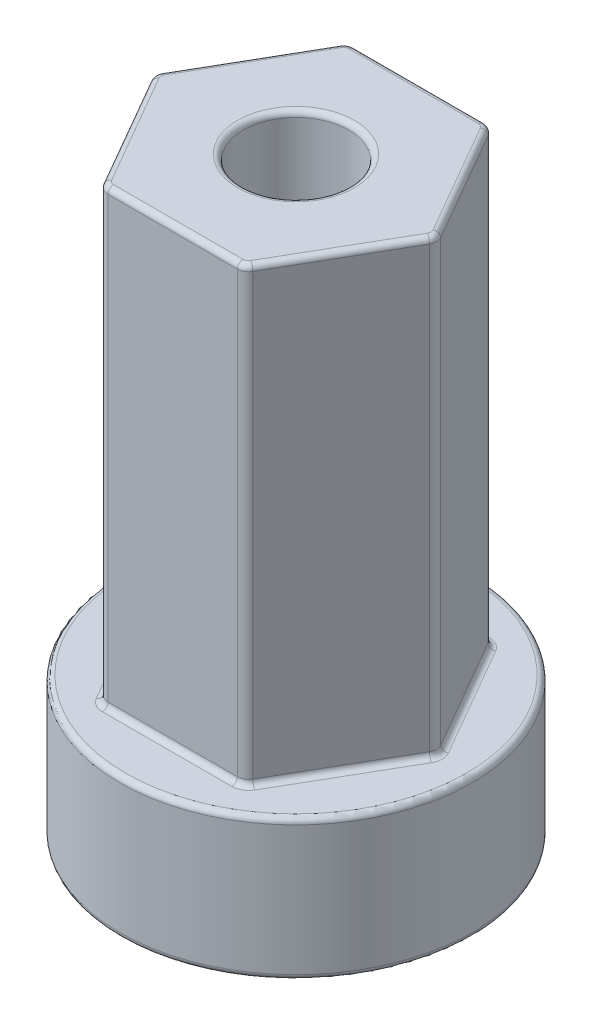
ISO-10303-21;
HEADER;
FILE_DESCRIPTION(('STEP AP214'),'2;1');
FILE_NAME('part.step','',(''),(''),'','','');
FILE_SCHEMA(('AUTOMOTIVE_DESIGN { 1 0 10303 214 1 1 1 1 }'));
ENDSEC;
DATA;
#1=APPLICATION_CONTEXT('core data for automotive mechanical design processes');
#2=APPLICATION_PROTOCOL_DEFINITION('international standard','automotive_design',2000,#1);
#3=PRODUCT_CONTEXT('',#1,'mechanical');
#4=PRODUCT('Part','Part','',(#3));
#5=PRODUCT_RELATED_PRODUCT_CATEGORY('part','',(#4));
#6=PRODUCT_DEFINITION_FORMATION('','',#4);
#7=PRODUCT_DEFINITION_CONTEXT('part definition',#1,'design');
#8=PRODUCT_DEFINITION('design','',#6,#7);
#9=PRODUCT_DEFINITION_SHAPE('','',#8);
#10=(LENGTH_UNIT() NAMED_UNIT(*) SI_UNIT(.MILLI.,.METRE.));
#11=(NAMED_UNIT(*) PLANE_ANGLE_UNIT() SI_UNIT($,.RADIAN.));
#12=(NAMED_UNIT(*) SI_UNIT($,.STERADIAN.) SOLID_ANGLE_UNIT());
#13=UNCERTAINTY_MEASURE_WITH_UNIT(LENGTH_MEASURE(1.E-05),#10,'distance_accuracy_value','');
#14=(GEOMETRIC_REPRESENTATION_CONTEXT(3) GLOBAL_UNCERTAINTY_ASSIGNED_CONTEXT((#13)) GLOBAL_UNIT_ASSIGNED_CONTEXT((#10,
#11,#12)) REPRESENTATION_CONTEXT('',''));
#15=CARTESIAN_POINT('',(0.,0.,0.));
#16=DIRECTION('',(0.,0.,1.));
#17=DIRECTION('',(1.,0.,0.));
#18=AXIS2_PLACEMENT_3D('',#15,#16,#17);
#19=CARTESIAN_POINT('',(0.,6.35,0.));
#20=DIRECTION('',(0.,1.,0.));
#21=DIRECTION('',(0.,0.,1.));
#22=AXIS2_PLACEMENT_3D('',#19,#20,#21);
#23=PLANE('',#22);
#24=DIRECTION('',(1.,0.,0.));
#25=VECTOR('',#24,1.);
#26=CARTESIAN_POINT('',(0.,6.35,5.81025));
#27=LINE('',#26,#25);
#28=CARTESIAN_POINT('',(2.91460849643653,6.35,5.81025));
#29=VERTEX_POINT('',#28);
#30=CARTESIAN_POINT('',(-2.91460849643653,6.35,5.81025));
#31=VERTEX_POINT('',#30);
#32=EDGE_CURVE('E34',#29,#31,#27,.F.);
#33=ORIENTED_EDGE('',*,*,#32,.T.);
#34=CARTESIAN_POINT('',(-2.91460849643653,6.35,5.04825));
#35=DIRECTION('',(0.,1.,0.));
#36=DIRECTION('',(0.,0.,1.));
#37=AXIS2_PLACEMENT_3D('',#34,#35,#36);
#38=CIRCLE('',#37,0.762);
#39=CARTESIAN_POINT('',(-3.57451985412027,6.35,5.42925));
#40=VERTEX_POINT('',#39);
#41=EDGE_CURVE('E11',#31,#40,#38,.F.);
#42=ORIENTED_EDGE('',*,*,#41,.T.);
#43=DIRECTION('',(0.5,0.,0.866025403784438));
#44=VECTOR('',#43,1.);
#45=CARTESIAN_POINT('',(-5.03182410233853,6.35,2.905125));
#46=LINE('',#45,#44);
#47=CARTESIAN_POINT('',(-6.4891283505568,6.35,0.381000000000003));
#48=VERTEX_POINT('',#47);
#49=EDGE_CURVE('E269',#40,#48,#46,.F.);
#50=ORIENTED_EDGE('',*,*,#49,.T.);
#51=CARTESIAN_POINT('',(-5.82921699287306,6.35,0.));
#52=DIRECTION('',(0.,1.,0.));
#53=DIRECTION('',(0.,0.,1.));
#54=AXIS2_PLACEMENT_3D('',#51,#52,#53);
#55=CIRCLE('',#54,0.762);
#56=CARTESIAN_POINT('',(-6.4891283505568,6.35,-0.380999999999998));
#57=VERTEX_POINT('',#56);
#58=EDGE_CURVE('E271',#48,#57,#55,.F.);
#59=ORIENTED_EDGE('',*,*,#58,.T.);
#60=DIRECTION('',(-0.5,0.,0.866025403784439));
#61=VECTOR('',#60,1.);
#62=CARTESIAN_POINT('',(-5.03182410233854,6.35,-2.905125));
#63=LINE('',#62,#61);
#64=CARTESIAN_POINT('',(-3.57451985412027,6.35,-5.42925));
#65=VERTEX_POINT('',#64);
#66=EDGE_CURVE('E273',#57,#65,#63,.F.);
#67=ORIENTED_EDGE('',*,*,#66,.T.);
#68=CARTESIAN_POINT('',(-2.91460849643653,6.35,-5.04825));
#69=DIRECTION('',(0.,1.,0.));
#70=DIRECTION('',(0.,0.,1.));
#71=AXIS2_PLACEMENT_3D('',#68,#69,#70);
#72=CIRCLE('',#71,0.762);
#73=CARTESIAN_POINT('',(-2.91460849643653,6.35,-5.81025));
#74=VERTEX_POINT('',#73);
#75=EDGE_CURVE('E275',#65,#74,#72,.F.);
#76=ORIENTED_EDGE('',*,*,#75,.T.);
#77=DIRECTION('',(-1.,0.,0.));
#78=VECTOR('',#77,1.);
#79=CARTESIAN_POINT('',(0.,6.35,-5.81025));
#80=LINE('',#79,#78);
#81=CARTESIAN_POINT('',(2.91460849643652,6.35,-5.81025));
#82=VERTEX_POINT('',#81);
#83=EDGE_CURVE('E277',#74,#82,#80,.F.);
#84=ORIENTED_EDGE('',*,*,#83,.T.);
#85=CARTESIAN_POINT('',(2.91460849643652,6.35,-5.04825));
#86=DIRECTION('',(0.,1.,0.));
#87=DIRECTION('',(0.,0.,1.));
#88=AXIS2_PLACEMENT_3D('',#85,#86,#87);
#89=CIRCLE('',#88,0.762);
#90=CARTESIAN_POINT('',(3.57451985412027,6.35,-5.42925));
#91=VERTEX_POINT('',#90);
#92=EDGE_CURVE('E279',#82,#91,#89,.F.);
#93=ORIENTED_EDGE('',*,*,#92,.T.);
#94=DIRECTION('',(-0.5,0.,-0.866025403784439));
#95=VECTOR('',#94,1.);
#96=CARTESIAN_POINT('',(5.03182410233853,6.35,-2.905125));
#97=LINE('',#96,#95);
#98=CARTESIAN_POINT('',(6.4891283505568,6.35,-0.381));
#99=VERTEX_POINT('',#98);
#100=EDGE_CURVE('E281',#91,#99,#97,.F.);
#101=ORIENTED_EDGE('',*,*,#100,.T.);
#102=CARTESIAN_POINT('',(5.82921699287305,6.35,0.));
#103=DIRECTION('',(0.,1.,0.));
#104=DIRECTION('',(0.,0.,1.));
#105=AXIS2_PLACEMENT_3D('',#102,#103,#104);
#106=CIRCLE('',#105,0.762);
#107=CARTESIAN_POINT('',(6.4891283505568,6.35,0.381));
#108=VERTEX_POINT('',#107);
#109=EDGE_CURVE('E283',#99,#108,#106,.F.);
#110=ORIENTED_EDGE('',*,*,#109,.T.);
#111=DIRECTION('',(0.5,0.,-0.866025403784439));
#112=VECTOR('',#111,1.);
#113=CARTESIAN_POINT('',(5.03182410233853,6.35,2.905125));
#114=LINE('',#113,#112);
#115=CARTESIAN_POINT('',(3.57451985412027,6.35,5.42925));
#116=VERTEX_POINT('',#115);
#117=EDGE_CURVE('E285',#108,#116,#114,.F.);
#118=ORIENTED_EDGE('',*,*,#117,.T.);
#119=CARTESIAN_POINT('',(2.91460849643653,6.35,5.04825));
#120=DIRECTION('',(0.,1.,0.));
#121=DIRECTION('',(0.,0.,1.));
#122=AXIS2_PLACEMENT_3D('',#119,#120,#121);
#123=CIRCLE('',#122,0.762);
#124=EDGE_CURVE('E44',#116,#29,#123,.F.);
#125=ORIENTED_EDGE('',*,*,#124,.T.);
#126=EDGE_LOOP('',(#33,#42,#50,#59,#67,#76,#84,#93,#101,#110,#118,#125));
#127=FACE_BOUND('',#126,.T.);
#128=CARTESIAN_POINT('',(0.,6.35,0.));
#129=DIRECTION('',(0.,1.,0.));
#130=DIRECTION('',(0.,0.,1.));
#131=AXIS2_PLACEMENT_3D('',#128,#129,#130);
#132=CIRCLE('',#131,7.6835);
#133=CARTESIAN_POINT('',(0.,6.35,7.6835));
#134=VERTEX_POINT('',#133);
#135=EDGE_CURVE('E266',#134,#134,#132,.T.);
#136=ORIENTED_EDGE('',*,*,#135,.T.);
#137=EDGE_LOOP('',(#136));
#138=FACE_BOUND('',#137,.T.);
#139=ADVANCED_FACE('F26',(#127,#138),#23,.T.);
#140=CARTESIAN_POINT('',(0.,6.35,0.));
#141=DIRECTION('',(0.,-1.,0.));
#142=DIRECTION('',(0.,0.,-1.));
#143=AXIS2_PLACEMENT_3D('',#140,#141,#142);
#144=CYLINDRICAL_SURFACE('',#143,7.9375);
#145=CARTESIAN_POINT('',(0.,0.254,0.));
#146=DIRECTION('',(0.,1.,0.));
#147=DIRECTION('',(0.,0.,1.));
#148=AXIS2_PLACEMENT_3D('',#145,#146,#147);
#149=CIRCLE('',#148,7.9375);
#150=CARTESIAN_POINT('',(0.,0.254,7.9375));
#151=VERTEX_POINT('',#150);
#152=EDGE_CURVE('E419',#151,#151,#149,.T.);
#153=ORIENTED_EDGE('',*,*,#152,.T.);
#154=EDGE_LOOP('',(#153));
#155=FACE_BOUND('',#154,.T.);
#156=CARTESIAN_POINT('',(0.,6.096,0.));
#157=DIRECTION('',(0.,1.,0.));
#158=DIRECTION('',(0.,0.,1.));
#159=AXIS2_PLACEMENT_3D('',#156,#157,#158);
#160=CIRCLE('',#159,7.9375);
#161=CARTESIAN_POINT('',(0.,6.096,7.9375));
#162=VERTEX_POINT('',#161);
#163=EDGE_CURVE('E416',#162,#162,#160,.F.);
#164=ORIENTED_EDGE('',*,*,#163,.T.);
#165=EDGE_LOOP('',(#164));
#166=FACE_BOUND('',#165,.T.);
#167=ADVANCED_FACE('F28',(#155,#166),#144,.T.);
#168=CARTESIAN_POINT('',(0.,0.,0.));
#169=DIRECTION('',(0.,1.,0.));
#170=DIRECTION('',(0.,0.,1.));
#171=AXIS2_PLACEMENT_3D('',#168,#169,#170);
#172=PLANE('',#171);
#173=CARTESIAN_POINT('',(0.,0.,0.));
#174=DIRECTION('',(0.,1.,0.));
#175=DIRECTION('',(0.,0.,1.));
#176=AXIS2_PLACEMENT_3D('',#173,#174,#175);
#177=CIRCLE('',#176,7.6835);
#178=CARTESIAN_POINT('',(0.,0.,7.6835));
#179=VERTEX_POINT('',#178);
#180=EDGE_CURVE('E425',#179,#179,#177,.F.);
#181=ORIENTED_EDGE('',*,*,#180,.T.);
#182=EDGE_LOOP('',(#181));
#183=FACE_BOUND('',#182,.T.);
#184=CARTESIAN_POINT('',(0.,0.,0.));
#185=DIRECTION('',(0.,1.,0.));
#186=DIRECTION('',(0.,0.,1.));
#187=AXIS2_PLACEMENT_3D('',#184,#185,#186);
#188=CIRCLE('',#187,2.63525);
#189=CARTESIAN_POINT('',(0.,0.,2.63525));
#190=VERTEX_POINT('',#189);
#191=EDGE_CURVE('E422',#190,#190,#188,.T.);
#192=ORIENTED_EDGE('',*,*,#191,.T.);
#193=EDGE_LOOP('',(#192));
#194=FACE_BOUND('',#193,.T.);
#195=ADVANCED_FACE('F572',(#183,#194),#172,.F.);
#196=CARTESIAN_POINT('',(-3.20790243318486,26.67,-5.55625));
#197=DIRECTION('',(0.866025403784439,0.,0.5));
#198=DIRECTION('',(0.5,0.,-0.866025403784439));
#199=AXIS2_PLACEMENT_3D('',#196,#197,#198);
#200=PLANE('',#199);
#201=DIRECTION('',(0.,-1.,0.));
#202=VECTOR('',#201,1.);
#203=CARTESIAN_POINT('',(-6.26915789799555,26.67,-0.253999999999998));
#204=LINE('',#203,#202);
#205=CARTESIAN_POINT('',(-6.26915789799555,6.604,-0.253999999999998));
#206=VERTEX_POINT('',#205);
#207=CARTESIAN_POINT('',(-6.26915789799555,26.416,-0.253999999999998));
#208=VERTEX_POINT('',#207);
#209=EDGE_CURVE('E380',#206,#208,#204,.F.);
#210=ORIENTED_EDGE('',*,*,#209,.T.);
#211=DIRECTION('',(-0.5,0.,0.866025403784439));
#212=VECTOR('',#211,1.);
#213=CARTESIAN_POINT('',(-3.35454940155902,26.416,-5.30225));
#214=LINE('',#213,#212);
#215=CARTESIAN_POINT('',(-3.35454940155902,26.416,-5.30225));
#216=VERTEX_POINT('',#215);
#217=EDGE_CURVE('E256',#208,#216,#214,.F.);
#218=ORIENTED_EDGE('',*,*,#217,.T.);
#219=DIRECTION('',(0.,-1.,0.));
#220=VECTOR('',#219,1.);
#221=CARTESIAN_POINT('',(-3.35454940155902,26.67,-5.30225));
#222=LINE('',#221,#220);
#223=CARTESIAN_POINT('',(-3.35454940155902,6.604,-5.30225));
#224=VERTEX_POINT('',#223);
#225=EDGE_CURVE('E383',#216,#224,#222,.T.);
#226=ORIENTED_EDGE('',*,*,#225,.T.);
#227=DIRECTION('',(-0.5,0.,0.866025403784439));
#228=VECTOR('',#227,1.);
#229=CARTESIAN_POINT('',(-3.20790243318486,6.604,-5.55625));
#230=LINE('',#229,#228);
#231=EDGE_CURVE('E254',#224,#206,#230,.T.);
#232=ORIENTED_EDGE('',*,*,#231,.T.);
#233=EDGE_LOOP('',(#210,#218,#226,#232));
#234=FACE_BOUND('',#233,.T.);
#235=ADVANCED_FACE('F535',(#234),#200,.F.);
#236=CARTESIAN_POINT('',(-6.41580486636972,26.67,0.));
#237=DIRECTION('',(0.866025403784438,0.,-0.5));
#238=DIRECTION('',(-0.5,0.,-0.866025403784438));
#239=AXIS2_PLACEMENT_3D('',#236,#237,#238);
#240=PLANE('',#239);
#241=DIRECTION('',(0.,-1.,0.));
#242=VECTOR('',#241,1.);
#243=CARTESIAN_POINT('',(-3.35454940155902,26.67,5.30225));
#244=LINE('',#243,#242);
#245=CARTESIAN_POINT('',(-3.35454940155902,6.604,5.30225));
#246=VERTEX_POINT('',#245);
#247=CARTESIAN_POINT('',(-3.35454940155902,26.416,5.30225));
#248=VERTEX_POINT('',#247);
#249=EDGE_CURVE('E413',#246,#248,#244,.F.);
#250=ORIENTED_EDGE('',*,*,#249,.T.);
#251=DIRECTION('',(0.5,0.,0.866025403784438));
#252=VECTOR('',#251,1.);
#253=CARTESIAN_POINT('',(-6.26915789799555,26.416,0.254000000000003));
#254=LINE('',#253,#252);
#255=CARTESIAN_POINT('',(-6.26915789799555,26.416,0.254000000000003));
#256=VERTEX_POINT('',#255);
#257=EDGE_CURVE('E248',#248,#256,#254,.F.);
#258=ORIENTED_EDGE('',*,*,#257,.T.);
#259=DIRECTION('',(0.,-1.,0.));
#260=VECTOR('',#259,1.);
#261=CARTESIAN_POINT('',(-6.26915789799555,26.67,0.254000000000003));
#262=LINE('',#261,#260);
#263=CARTESIAN_POINT('',(-6.26915789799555,6.604,0.254000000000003));
#264=VERTEX_POINT('',#263);
#265=EDGE_CURVE('E410',#256,#264,#262,.T.);
#266=ORIENTED_EDGE('',*,*,#265,.T.);
#267=DIRECTION('',(0.5,0.,0.866025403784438));
#268=VECTOR('',#267,1.);
#269=CARTESIAN_POINT('',(-6.41580486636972,6.604,0.));
#270=LINE('',#269,#268);
#271=EDGE_CURVE('E246',#264,#246,#270,.T.);
#272=ORIENTED_EDGE('',*,*,#271,.T.);
#273=EDGE_LOOP('',(#250,#258,#266,#272));
#274=FACE_BOUND('',#273,.T.);
#275=ADVANCED_FACE('F513',(#274),#240,.F.);
#276=CARTESIAN_POINT('',(-3.20790243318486,26.67,5.55625));
#277=DIRECTION('',(0.,0.,-1.));
#278=DIRECTION('',(-1.,0.,0.));
#279=AXIS2_PLACEMENT_3D('',#276,#277,#278);
#280=PLANE('',#279);
#281=DIRECTION('',(0.,-1.,0.));
#282=VECTOR('',#281,1.);
#283=CARTESIAN_POINT('',(2.91460849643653,26.67,5.55625));
#284=LINE('',#283,#282);
#285=CARTESIAN_POINT('',(2.91460849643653,6.604,5.55625));
#286=VERTEX_POINT('',#285);
#287=CARTESIAN_POINT('',(2.91460849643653,26.416,5.55625));
#288=VERTEX_POINT('',#287);
#289=EDGE_CURVE('E407',#286,#288,#284,.F.);
#290=ORIENTED_EDGE('',*,*,#289,.T.);
#291=DIRECTION('',(1.,0.,0.));
#292=VECTOR('',#291,1.);
#293=CARTESIAN_POINT('',(-2.91460849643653,26.416,5.55625));
#294=LINE('',#293,#292);
#295=CARTESIAN_POINT('',(-2.91460849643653,26.416,5.55625));
#296=VERTEX_POINT('',#295);
#297=EDGE_CURVE('E239',#288,#296,#294,.F.);
#298=ORIENTED_EDGE('',*,*,#297,.T.);
#299=DIRECTION('',(0.,-1.,0.));
#300=VECTOR('',#299,1.);
#301=CARTESIAN_POINT('',(-2.91460849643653,26.67,5.55625));
#302=LINE('',#301,#300);
#303=CARTESIAN_POINT('',(-2.91460849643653,6.604,5.55625));
#304=VERTEX_POINT('',#303);
#305=EDGE_CURVE('E404',#296,#304,#302,.T.);
#306=ORIENTED_EDGE('',*,*,#305,.T.);
#307=DIRECTION('',(1.,0.,0.));
#308=VECTOR('',#307,1.);
#309=CARTESIAN_POINT('',(-3.20790243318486,6.604,5.55625));
#310=LINE('',#309,#308);
#311=EDGE_CURVE('E237',#304,#286,#310,.T.);
#312=ORIENTED_EDGE('',*,*,#311,.T.);
#313=EDGE_LOOP('',(#290,#298,#306,#312));
#314=FACE_BOUND('',#313,.T.);
#315=ADVANCED_FACE('F497',(#314),#280,.F.);
#316=CARTESIAN_POINT('',(3.20790243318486,26.67,5.55625));
#317=DIRECTION('',(-0.866025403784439,0.,-0.5));
#318=DIRECTION('',(-0.5,0.,0.866025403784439));
#319=AXIS2_PLACEMENT_3D('',#316,#317,#318);
#320=PLANE('',#319);
#321=DIRECTION('',(0.,-1.,0.));
#322=VECTOR('',#321,1.);
#323=CARTESIAN_POINT('',(6.26915789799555,26.67,0.254));
#324=LINE('',#323,#322);
#325=CARTESIAN_POINT('',(6.26915789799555,6.604,0.254));
#326=VERTEX_POINT('',#325);
#327=CARTESIAN_POINT('',(6.26915789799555,26.416,0.254));
#328=VERTEX_POINT('',#327);
#329=EDGE_CURVE('E401',#326,#328,#324,.F.);
#330=ORIENTED_EDGE('',*,*,#329,.T.);
#331=DIRECTION('',(0.5,0.,-0.866025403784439));
#332=VECTOR('',#331,1.);
#333=CARTESIAN_POINT('',(3.35454940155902,26.416,5.30225));
#334=LINE('',#333,#332);
#335=CARTESIAN_POINT('',(3.35454940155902,26.416,5.30225));
#336=VERTEX_POINT('',#335);
#337=EDGE_CURVE('E231',#328,#336,#334,.F.);
#338=ORIENTED_EDGE('',*,*,#337,.T.);
#339=DIRECTION('',(0.,-1.,0.));
#340=VECTOR('',#339,1.);
#341=CARTESIAN_POINT('',(3.35454940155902,26.67,5.30225));
#342=LINE('',#341,#340);
#343=CARTESIAN_POINT('',(3.35454940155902,6.604,5.30225));
#344=VERTEX_POINT('',#343);
#345=EDGE_CURVE('E398',#336,#344,#342,.T.);
#346=ORIENTED_EDGE('',*,*,#345,.T.);
#347=DIRECTION('',(0.5,0.,-0.866025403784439));
#348=VECTOR('',#347,1.);
#349=CARTESIAN_POINT('',(3.20790243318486,6.604,5.55625));
#350=LINE('',#349,#348);
#351=EDGE_CURVE('E229',#344,#326,#350,.T.);
#352=ORIENTED_EDGE('',*,*,#351,.T.);
#353=EDGE_LOOP('',(#330,#338,#346,#352));
#354=FACE_BOUND('',#353,.T.);
#355=ADVANCED_FACE('F482',(#354),#320,.F.);
#356=CARTESIAN_POINT('',(6.41580486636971,26.67,0.));
#357=DIRECTION('',(-0.866025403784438,0.,0.5));
#358=DIRECTION('',(0.5,0.,0.866025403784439));
#359=AXIS2_PLACEMENT_3D('',#356,#357,#358);
#360=PLANE('',#359);
#361=DIRECTION('',(0.,-1.,0.));
#362=VECTOR('',#361,1.);
#363=CARTESIAN_POINT('',(3.35454940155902,26.67,-5.30225));
#364=LINE('',#363,#362);
#365=CARTESIAN_POINT('',(3.35454940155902,6.604,-5.30225));
#366=VERTEX_POINT('',#365);
#367=CARTESIAN_POINT('',(3.35454940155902,26.416,-5.30225));
#368=VERTEX_POINT('',#367);
#369=EDGE_CURVE('E395',#366,#368,#364,.F.);
#370=ORIENTED_EDGE('',*,*,#369,.T.);
#371=DIRECTION('',(-0.5,0.,-0.866025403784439));
#372=VECTOR('',#371,1.);
#373=CARTESIAN_POINT('',(6.26915789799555,26.416,-0.253999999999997));
#374=LINE('',#373,#372);
#375=CARTESIAN_POINT('',(6.26915789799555,26.416,-0.254));
#376=VERTEX_POINT('',#375);
#377=EDGE_CURVE('E223',#368,#376,#374,.F.);
#378=ORIENTED_EDGE('',*,*,#377,.T.);
#379=DIRECTION('',(0.,-1.,0.));
#380=VECTOR('',#379,1.);
#381=CARTESIAN_POINT('',(6.26915789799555,26.67,-0.254));
#382=LINE('',#381,#380);
#383=CARTESIAN_POINT('',(6.26915789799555,6.604,-0.254));
#384=VERTEX_POINT('',#383);
#385=EDGE_CURVE('E392',#376,#384,#382,.T.);
#386=ORIENTED_EDGE('',*,*,#385,.T.);
#387=DIRECTION('',(-0.5,0.,-0.866025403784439));
#388=VECTOR('',#387,1.);
#389=CARTESIAN_POINT('',(6.41580486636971,6.604,0.));
#390=LINE('',#389,#388);
#391=EDGE_CURVE('E221',#384,#366,#390,.T.);
#392=ORIENTED_EDGE('',*,*,#391,.T.);
#393=EDGE_LOOP('',(#370,#378,#386,#392));
#394=FACE_BOUND('',#393,.T.);
#395=ADVANCED_FACE('F467',(#394),#360,.F.);
#396=CARTESIAN_POINT('',(3.20790243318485,26.67,-5.55625));
#397=DIRECTION('',(0.,0.,1.));
#398=DIRECTION('',(1.,0.,0.));
#399=AXIS2_PLACEMENT_3D('',#396,#397,#398);
#400=PLANE('',#399);
#401=DIRECTION('',(0.,-1.,0.));
#402=VECTOR('',#401,1.);
#403=CARTESIAN_POINT('',(-2.91460849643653,26.67,-5.55625));
#404=LINE('',#403,#402);
#405=CARTESIAN_POINT('',(-2.91460849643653,6.604,-5.55625));
#406=VERTEX_POINT('',#405);
#407=CARTESIAN_POINT('',(-2.91460849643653,26.416,-5.55625));
#408=VERTEX_POINT('',#407);
#409=EDGE_CURVE('E389',#406,#408,#404,.F.);
#410=ORIENTED_EDGE('',*,*,#409,.T.);
#411=DIRECTION('',(-1.,0.,0.));
#412=VECTOR('',#411,1.);
#413=CARTESIAN_POINT('',(2.91460849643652,26.416,-5.55625));
#414=LINE('',#413,#412);
#415=CARTESIAN_POINT('',(2.91460849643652,26.416,-5.55625));
#416=VERTEX_POINT('',#415);
#417=EDGE_CURVE('E264',#408,#416,#414,.F.);
#418=ORIENTED_EDGE('',*,*,#417,.T.);
#419=DIRECTION('',(0.,-1.,0.));
#420=VECTOR('',#419,1.);
#421=CARTESIAN_POINT('',(2.91460849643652,26.67,-5.55625));
#422=LINE('',#421,#420);
#423=CARTESIAN_POINT('',(2.91460849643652,6.604,-5.55625));
#424=VERTEX_POINT('',#423);
#425=EDGE_CURVE('E386',#416,#424,#422,.T.);
#426=ORIENTED_EDGE('',*,*,#425,.T.);
#427=DIRECTION('',(-1.,0.,0.));
#428=VECTOR('',#427,1.);
#429=CARTESIAN_POINT('',(3.20790243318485,6.604,-5.55625));
#430=LINE('',#429,#428);
#431=EDGE_CURVE('E262',#424,#406,#430,.T.);
#432=ORIENTED_EDGE('',*,*,#431,.T.);
#433=EDGE_LOOP('',(#410,#418,#426,#432));
#434=FACE_BOUND('',#433,.T.);
#435=ADVANCED_FACE('F557',(#434),#400,.F.);
#436=CARTESIAN_POINT('',(-6.41580486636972,26.67,0.));
#437=DIRECTION('',(0.,1.,0.));
#438=DIRECTION('',(0.,0.,1.));
#439=AXIS2_PLACEMENT_3D('',#436,#437,#438);
#440=PLANE('',#439);
#441=DIRECTION('',(-0.5,0.,-0.866025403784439));
#442=VECTOR('',#441,1.);
#443=CARTESIAN_POINT('',(3.13457894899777,26.67,-5.17525));
#444=LINE('',#443,#442);
#445=CARTESIAN_POINT('',(6.0491874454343,26.67,-0.127));
#446=VERTEX_POINT('',#445);
#447=CARTESIAN_POINT('',(3.13457894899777,26.67,-5.17525));
#448=VERTEX_POINT('',#447);
#449=EDGE_CURVE('E211',#446,#448,#444,.T.);
#450=ORIENTED_EDGE('',*,*,#449,.T.);
#451=CARTESIAN_POINT('',(2.91460849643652,26.67,-5.04825));
#452=DIRECTION('',(0.,1.,0.));
#453=DIRECTION('',(0.,0.,1.));
#454=AXIS2_PLACEMENT_3D('',#451,#452,#453);
#455=CIRCLE('',#454,0.254);
#456=CARTESIAN_POINT('',(2.91460849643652,26.67,-5.30225));
#457=VERTEX_POINT('',#456);
#458=EDGE_CURVE('E190',#448,#457,#455,.T.);
#459=ORIENTED_EDGE('',*,*,#458,.T.);
#460=DIRECTION('',(-1.,0.,0.));
#461=VECTOR('',#460,1.);
#462=CARTESIAN_POINT('',(-2.91460849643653,26.67,-5.30225));
#463=LINE('',#462,#461);
#464=CARTESIAN_POINT('',(-2.91460849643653,26.67,-5.30225));
#465=VERTEX_POINT('',#464);
#466=EDGE_CURVE('E199',#457,#465,#463,.T.);
#467=ORIENTED_EDGE('',*,*,#466,.T.);
#468=CARTESIAN_POINT('',(-2.91460849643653,26.67,-5.04825));
#469=DIRECTION('',(0.,1.,0.));
#470=DIRECTION('',(0.,0.,1.));
#471=AXIS2_PLACEMENT_3D('',#468,#469,#470);
#472=CIRCLE('',#471,0.254);
#473=CARTESIAN_POINT('',(-3.13457894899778,26.67,-5.17525));
#474=VERTEX_POINT('',#473);
#475=EDGE_CURVE('E205',#465,#474,#472,.T.);
#476=ORIENTED_EDGE('',*,*,#475,.T.);
#477=DIRECTION('',(-0.5,0.,0.866025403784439));
#478=VECTOR('',#477,1.);
#479=CARTESIAN_POINT('',(-6.04918744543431,26.67,-0.126999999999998));
#480=LINE('',#479,#478);
#481=CARTESIAN_POINT('',(-6.04918744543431,26.67,-0.126999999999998));
#482=VERTEX_POINT('',#481);
#483=EDGE_CURVE('E437',#474,#482,#480,.T.);
#484=ORIENTED_EDGE('',*,*,#483,.T.);
#485=CARTESIAN_POINT('',(-5.82921699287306,26.67,0.));
#486=DIRECTION('',(0.,1.,0.));
#487=DIRECTION('',(0.,0.,1.));
#488=AXIS2_PLACEMENT_3D('',#485,#486,#487);
#489=CIRCLE('',#488,0.254);
#490=CARTESIAN_POINT('',(-6.0491874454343,26.67,0.127000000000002));
#491=VERTEX_POINT('',#490);
#492=EDGE_CURVE('E439',#482,#491,#489,.T.);
#493=ORIENTED_EDGE('',*,*,#492,.T.);
#494=DIRECTION('',(0.5,0.,0.866025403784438));
#495=VECTOR('',#494,1.);
#496=CARTESIAN_POINT('',(-3.13457894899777,26.67,5.17525));
#497=LINE('',#496,#495);
#498=CARTESIAN_POINT('',(-3.13457894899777,26.67,5.17525));
#499=VERTEX_POINT('',#498);
#500=EDGE_CURVE('E441',#491,#499,#497,.T.);
#501=ORIENTED_EDGE('',*,*,#500,.T.);
#502=CARTESIAN_POINT('',(-2.91460849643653,26.67,5.04825));
#503=DIRECTION('',(0.,1.,0.));
#504=DIRECTION('',(0.,0.,1.));
#505=AXIS2_PLACEMENT_3D('',#502,#503,#504);
#506=CIRCLE('',#505,0.254);
#507=CARTESIAN_POINT('',(-2.91460849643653,26.67,5.30225));
#508=VERTEX_POINT('',#507);
#509=EDGE_CURVE('E443',#499,#508,#506,.T.);
#510=ORIENTED_EDGE('',*,*,#509,.T.);
#511=DIRECTION('',(1.,0.,0.));
#512=VECTOR('',#511,1.);
#513=CARTESIAN_POINT('',(2.91460849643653,26.67,5.30225));
#514=LINE('',#513,#512);
#515=CARTESIAN_POINT('',(2.91460849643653,26.67,5.30225));
#516=VERTEX_POINT('',#515);
#517=EDGE_CURVE('E445',#508,#516,#514,.T.);
#518=ORIENTED_EDGE('',*,*,#517,.T.);
#519=CARTESIAN_POINT('',(2.91460849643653,26.67,5.04825));
#520=DIRECTION('',(0.,1.,0.));
#521=DIRECTION('',(0.,0.,1.));
#522=AXIS2_PLACEMENT_3D('',#519,#520,#521);
#523=CIRCLE('',#522,0.254);
#524=CARTESIAN_POINT('',(3.13457894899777,26.67,5.17525));
#525=VERTEX_POINT('',#524);
#526=EDGE_CURVE('E447',#516,#525,#523,.T.);
#527=ORIENTED_EDGE('',*,*,#526,.T.);
#528=DIRECTION('',(0.5,0.,-0.866025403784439));
#529=VECTOR('',#528,1.);
#530=CARTESIAN_POINT('',(6.0491874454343,26.67,0.126999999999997));
#531=LINE('',#530,#529);
#532=CARTESIAN_POINT('',(6.0491874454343,26.67,0.126999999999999));
#533=VERTEX_POINT('',#532);
#534=EDGE_CURVE('E449',#525,#533,#531,.T.);
#535=ORIENTED_EDGE('',*,*,#534,.T.);
#536=CARTESIAN_POINT('',(5.82921699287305,26.67,0.));
#537=DIRECTION('',(0.,1.,0.));
#538=DIRECTION('',(0.,0.,1.));
#539=AXIS2_PLACEMENT_3D('',#536,#537,#538);
#540=CIRCLE('',#539,0.254);
#541=EDGE_CURVE('E216',#533,#446,#540,.T.);
#542=ORIENTED_EDGE('',*,*,#541,.T.);
#543=EDGE_LOOP('',(#450,#459,#467,#476,#484,#493,#501,#510,#518,#527,#535,#542));
#544=FACE_BOUND('',#543,.T.);
#545=CARTESIAN_POINT('',(0.,26.67,0.));
#546=DIRECTION('',(0.,1.,0.));
#547=DIRECTION('',(0.,0.,1.));
#548=AXIS2_PLACEMENT_3D('',#545,#546,#547);
#549=CIRCLE('',#548,2.63525);
#550=CARTESIAN_POINT('',(0.,26.67,2.63525));
#551=VERTEX_POINT('',#550);
#552=EDGE_CURVE('E206',#551,#551,#549,.F.);
#553=ORIENTED_EDGE('',*,*,#552,.T.);
#554=EDGE_LOOP('',(#553));
#555=FACE_BOUND('',#554,.T.);
#556=ADVANCED_FACE('F208',(#544,#555),#440,.T.);
#557=CARTESIAN_POINT('',(0.,0.,0.));
#558=DIRECTION('',(0.,1.,0.));
#559=DIRECTION('',(0.,0.,1.));
#560=AXIS2_PLACEMENT_3D('',#557,#558,#559);
#561=CYLINDRICAL_SURFACE('',#560,2.38125);
#562=CARTESIAN_POINT('',(0.,0.254,0.));
#563=DIRECTION('',(0.,1.,0.));
#564=DIRECTION('',(0.,0.,1.));
#565=AXIS2_PLACEMENT_3D('',#562,#563,#564);
#566=CIRCLE('',#565,2.38125);
#567=CARTESIAN_POINT('',(0.,0.254,2.38125));
#568=VERTEX_POINT('',#567);
#569=EDGE_CURVE('E431',#568,#568,#566,.F.);
#570=ORIENTED_EDGE('',*,*,#569,.T.);
#571=EDGE_LOOP('',(#570));
#572=FACE_BOUND('',#571,.T.);
#573=CARTESIAN_POINT('',(0.,26.416,0.));
#574=DIRECTION('',(0.,1.,0.));
#575=DIRECTION('',(0.,0.,1.));
#576=AXIS2_PLACEMENT_3D('',#573,#574,#575);
#577=CIRCLE('',#576,2.38125);
#578=CARTESIAN_POINT('',(0.,26.416,2.38125));
#579=VERTEX_POINT('',#578);
#580=EDGE_CURVE('E428',#579,#579,#577,.T.);
#581=ORIENTED_EDGE('',*,*,#580,.T.);
#582=EDGE_LOOP('',(#581));
#583=FACE_BOUND('',#582,.T.);
#584=ADVANCED_FACE('F592',(#572,#583),#561,.F.);
#585=CARTESIAN_POINT('',(-2.91460849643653,26.67,-5.04825));
#586=DIRECTION('',(0.,-1.,0.));
#587=DIRECTION('',(0.,0.,-1.));
#588=AXIS2_PLACEMENT_3D('',#585,#586,#587);
#589=CYLINDRICAL_SURFACE('',#588,0.508);
#590=ORIENTED_EDGE('',*,*,#225,.F.);
#591=CARTESIAN_POINT('',(-2.91460849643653,26.416,-5.04825));
#592=DIRECTION('',(0.,1.,0.));
#593=DIRECTION('',(0.,0.,1.));
#594=AXIS2_PLACEMENT_3D('',#591,#592,#593);
#595=CIRCLE('',#594,0.508);
#596=EDGE_CURVE('E260',#216,#408,#595,.F.);
#597=ORIENTED_EDGE('',*,*,#596,.T.);
#598=ORIENTED_EDGE('',*,*,#409,.F.);
#599=CARTESIAN_POINT('',(-2.91460849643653,6.604,-5.04825));
#600=DIRECTION('',(0.,1.,0.));
#601=DIRECTION('',(0.,0.,1.));
#602=AXIS2_PLACEMENT_3D('',#599,#600,#601);
#603=CIRCLE('',#602,0.508);
#604=EDGE_CURVE('E258',#406,#224,#603,.T.);
#605=ORIENTED_EDGE('',*,*,#604,.T.);
#606=EDGE_LOOP('',(#590,#597,#598,#605));
#607=FACE_BOUND('',#606,.T.);
#608=ADVANCED_FACE('F538',(#607),#589,.T.);
#609=CARTESIAN_POINT('',(2.91460849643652,26.67,-5.04825));
#610=DIRECTION('',(0.,-1.,0.));
#611=DIRECTION('',(0.,0.,-1.));
#612=AXIS2_PLACEMENT_3D('',#609,#610,#611);
#613=CYLINDRICAL_SURFACE('',#612,0.508);
#614=ORIENTED_EDGE('',*,*,#425,.F.);
#615=CARTESIAN_POINT('',(2.91460849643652,26.416,-5.04825));
#616=DIRECTION('',(0.,1.,0.));
#617=DIRECTION('',(0.,0.,1.));
#618=AXIS2_PLACEMENT_3D('',#615,#616,#617);
#619=CIRCLE('',#618,0.508);
#620=EDGE_CURVE('E192',#416,#368,#619,.F.);
#621=ORIENTED_EDGE('',*,*,#620,.T.);
#622=ORIENTED_EDGE('',*,*,#369,.F.);
#623=CARTESIAN_POINT('',(2.91460849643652,6.604,-5.04825));
#624=DIRECTION('',(0.,1.,0.));
#625=DIRECTION('',(0.,0.,1.));
#626=AXIS2_PLACEMENT_3D('',#623,#624,#625);
#627=CIRCLE('',#626,0.508);
#628=EDGE_CURVE('E213',#366,#424,#627,.T.);
#629=ORIENTED_EDGE('',*,*,#628,.T.);
#630=EDGE_LOOP('',(#614,#621,#622,#629));
#631=FACE_BOUND('',#630,.T.);
#632=ADVANCED_FACE('F465',(#631),#613,.T.);
#633=CARTESIAN_POINT('',(5.82921699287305,26.67,0.));
#634=DIRECTION('',(0.,-1.,0.));
#635=DIRECTION('',(0.,0.,-1.));
#636=AXIS2_PLACEMENT_3D('',#633,#634,#635);
#637=CYLINDRICAL_SURFACE('',#636,0.508);
#638=ORIENTED_EDGE('',*,*,#385,.F.);
#639=CARTESIAN_POINT('',(5.82921699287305,26.416,0.));
#640=DIRECTION('',(0.,1.,0.));
#641=DIRECTION('',(0.,0.,1.));
#642=AXIS2_PLACEMENT_3D('',#639,#640,#641);
#643=CIRCLE('',#642,0.508);
#644=EDGE_CURVE('E227',#376,#328,#643,.F.);
#645=ORIENTED_EDGE('',*,*,#644,.T.);
#646=ORIENTED_EDGE('',*,*,#329,.F.);
#647=CARTESIAN_POINT('',(5.82921699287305,6.604,0.));
#648=DIRECTION('',(0.,1.,0.));
#649=DIRECTION('',(0.,0.,1.));
#650=AXIS2_PLACEMENT_3D('',#647,#648,#649);
#651=CIRCLE('',#650,0.508);
#652=EDGE_CURVE('E225',#326,#384,#651,.T.);
#653=ORIENTED_EDGE('',*,*,#652,.T.);
#654=EDGE_LOOP('',(#638,#645,#646,#653));
#655=FACE_BOUND('',#654,.T.);
#656=ADVANCED_FACE('F479',(#655),#637,.T.);
#657=CARTESIAN_POINT('',(2.91460849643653,26.67,5.04825));
#658=DIRECTION('',(0.,-1.,0.));
#659=DIRECTION('',(0.,0.,-1.));
#660=AXIS2_PLACEMENT_3D('',#657,#658,#659);
#661=CYLINDRICAL_SURFACE('',#660,0.508);
#662=ORIENTED_EDGE('',*,*,#345,.F.);
#663=CARTESIAN_POINT('',(2.91460849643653,26.416,5.04825));
#664=DIRECTION('',(0.,1.,0.));
#665=DIRECTION('',(0.,0.,1.));
#666=AXIS2_PLACEMENT_3D('',#663,#664,#665);
#667=CIRCLE('',#666,0.508);
#668=EDGE_CURVE('E235',#336,#288,#667,.F.);
#669=ORIENTED_EDGE('',*,*,#668,.T.);
#670=ORIENTED_EDGE('',*,*,#289,.F.);
#671=CARTESIAN_POINT('',(2.91460849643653,6.604,5.04825));
#672=DIRECTION('',(0.,1.,0.));
#673=DIRECTION('',(0.,0.,1.));
#674=AXIS2_PLACEMENT_3D('',#671,#672,#673);
#675=CIRCLE('',#674,0.508);
#676=EDGE_CURVE('E233',#286,#344,#675,.T.);
#677=ORIENTED_EDGE('',*,*,#676,.T.);
#678=EDGE_LOOP('',(#662,#669,#670,#677));
#679=FACE_BOUND('',#678,.T.);
#680=ADVANCED_FACE('F494',(#679),#661,.T.);
#681=CARTESIAN_POINT('',(-2.91460849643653,26.67,5.04825));
#682=DIRECTION('',(0.,-1.,0.));
#683=DIRECTION('',(0.,0.,-1.));
#684=AXIS2_PLACEMENT_3D('',#681,#682,#683);
#685=CYLINDRICAL_SURFACE('',#684,0.508);
#686=ORIENTED_EDGE('',*,*,#305,.F.);
#687=CARTESIAN_POINT('',(-2.91460849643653,26.416,5.04825));
#688=DIRECTION('',(0.,1.,0.));
#689=DIRECTION('',(0.,0.,1.));
#690=AXIS2_PLACEMENT_3D('',#687,#688,#689);
#691=CIRCLE('',#690,0.508);
#692=EDGE_CURVE('E244',#296,#248,#691,.F.);
#693=ORIENTED_EDGE('',*,*,#692,.T.);
#694=ORIENTED_EDGE('',*,*,#249,.F.);
#695=CARTESIAN_POINT('',(-2.91460849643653,6.604,5.04825));
#696=DIRECTION('',(0.,1.,0.));
#697=DIRECTION('',(0.,0.,1.));
#698=AXIS2_PLACEMENT_3D('',#695,#696,#697);
#699=CIRCLE('',#698,0.508);
#700=EDGE_CURVE('E241',#246,#304,#699,.T.);
#701=ORIENTED_EDGE('',*,*,#700,.T.);
#702=EDGE_LOOP('',(#686,#693,#694,#701));
#703=FACE_BOUND('',#702,.T.);
#704=ADVANCED_FACE('F511',(#703),#685,.T.);
#705=CARTESIAN_POINT('',(-5.82921699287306,26.67,0.));
#706=DIRECTION('',(0.,-1.,0.));
#707=DIRECTION('',(0.,0.,-1.));
#708=AXIS2_PLACEMENT_3D('',#705,#706,#707);
#709=CYLINDRICAL_SURFACE('',#708,0.508);
#710=ORIENTED_EDGE('',*,*,#265,.F.);
#711=CARTESIAN_POINT('',(-5.82921699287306,26.416,0.));
#712=DIRECTION('',(0.,1.,0.));
#713=DIRECTION('',(0.,0.,1.));
#714=AXIS2_PLACEMENT_3D('',#711,#712,#713);
#715=CIRCLE('',#714,0.508);
#716=EDGE_CURVE('E252',#256,#208,#715,.F.);
#717=ORIENTED_EDGE('',*,*,#716,.T.);
#718=ORIENTED_EDGE('',*,*,#209,.F.);
#719=CARTESIAN_POINT('',(-5.82921699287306,6.604,0.));
#720=DIRECTION('',(0.,1.,0.));
#721=DIRECTION('',(0.,0.,1.));
#722=AXIS2_PLACEMENT_3D('',#719,#720,#721);
#723=CIRCLE('',#722,0.508);
#724=EDGE_CURVE('E250',#206,#264,#723,.T.);
#725=ORIENTED_EDGE('',*,*,#724,.T.);
#726=EDGE_LOOP('',(#710,#717,#718,#725));
#727=FACE_BOUND('',#726,.T.);
#728=ADVANCED_FACE('F517',(#727),#709,.T.);
#729=CARTESIAN_POINT('',(0.,0.254,0.));
#730=DIRECTION('',(0.,1.,0.));
#731=DIRECTION('',(0.,0.,1.));
#732=AXIS2_PLACEMENT_3D('',#729,#730,#731);
#733=TOROIDAL_SURFACE('',#732,7.6835,0.254);
#734=ORIENTED_EDGE('',*,*,#180,.F.);
#735=EDGE_LOOP('',(#734));
#736=FACE_BOUND('',#735,.T.);
#737=ORIENTED_EDGE('',*,*,#152,.F.);
#738=EDGE_LOOP('',(#737));
#739=FACE_BOUND('',#738,.T.);
#740=ADVANCED_FACE('F608',(#736,#739),#733,.T.);
#741=CARTESIAN_POINT('',(0.,0.254,0.));
#742=DIRECTION('',(0.,1.,0.));
#743=DIRECTION('',(0.,0.,1.));
#744=AXIS2_PLACEMENT_3D('',#741,#742,#743);
#745=TOROIDAL_SURFACE('',#744,2.63525,0.254);
#746=ORIENTED_EDGE('',*,*,#569,.F.);
#747=EDGE_LOOP('',(#746));
#748=FACE_BOUND('',#747,.T.);
#749=ORIENTED_EDGE('',*,*,#191,.F.);
#750=EDGE_LOOP('',(#749));
#751=FACE_BOUND('',#750,.T.);
#752=ADVANCED_FACE('F611',(#748,#751),#745,.T.);
#753=CARTESIAN_POINT('',(-2.91460849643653,26.416,5.04825));
#754=DIRECTION('',(0.,1.,0.));
#755=DIRECTION('',(0.,0.,1.));
#756=AXIS2_PLACEMENT_3D('',#753,#754,#755);
#757=DEGENERATE_TOROIDAL_SURFACE('',#756,0.254,0.254,.T.);
#758=CARTESIAN_POINT('',(-3.13457894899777,26.416,5.17525));
#759=DIRECTION('',(-0.500000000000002,0.,-0.866025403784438));
#760=DIRECTION('',(-0.866025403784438,0.,0.500000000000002));
#761=AXIS2_PLACEMENT_3D('',#758,#759,#760);
#762=CIRCLE('',#761,0.254);
#763=EDGE_CURVE('E374',#248,#499,#762,.T.);
#764=ORIENTED_EDGE('',*,*,#763,.F.);
#765=ORIENTED_EDGE('',*,*,#692,.F.);
#766=CARTESIAN_POINT('',(-2.91460849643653,26.416,5.30225));
#767=DIRECTION('',(1.,0.,0.));
#768=DIRECTION('',(0.,0.,-1.));
#769=AXIS2_PLACEMENT_3D('',#766,#767,#768);
#770=CIRCLE('',#769,0.254);
#771=EDGE_CURVE('E377',#508,#296,#770,.T.);
#772=ORIENTED_EDGE('',*,*,#771,.F.);
#773=ORIENTED_EDGE('',*,*,#509,.F.);
#774=EDGE_LOOP('',(#764,#765,#772,#773));
#775=FACE_BOUND('',#774,.T.);
#776=ADVANCED_FACE('F507',(#775),#757,.T.);
#777=CARTESIAN_POINT('',(-6.41580486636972,26.416,5.30225));
#778=DIRECTION('',(-1.,0.,0.));
#779=DIRECTION('',(0.,0.,1.));
#780=AXIS2_PLACEMENT_3D('',#777,#778,#779);
#781=CYLINDRICAL_SURFACE('',#780,0.254);
#782=ORIENTED_EDGE('',*,*,#771,.T.);
#783=ORIENTED_EDGE('',*,*,#297,.F.);
#784=CARTESIAN_POINT('',(2.91460849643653,26.416,5.30225));
#785=DIRECTION('',(1.,0.,0.));
#786=DIRECTION('',(0.,0.,-1.));
#787=AXIS2_PLACEMENT_3D('',#784,#785,#786);
#788=CIRCLE('',#787,0.254);
#789=EDGE_CURVE('E371',#516,#288,#788,.T.);
#790=ORIENTED_EDGE('',*,*,#789,.F.);
#791=ORIENTED_EDGE('',*,*,#517,.F.);
#792=EDGE_LOOP('',(#782,#783,#790,#791));
#793=FACE_BOUND('',#792,.T.);
#794=ADVANCED_FACE('F500',(#793),#781,.T.);
#795=CARTESIAN_POINT('',(-6.19583441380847,26.416,-0.126999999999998));
#796=DIRECTION('',(-0.5,0.,-0.866025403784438));
#797=DIRECTION('',(-0.866025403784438,0.,0.5));
#798=AXIS2_PLACEMENT_3D('',#795,#796,#797);
#799=CYLINDRICAL_SURFACE('',#798,0.254);
#800=ORIENTED_EDGE('',*,*,#763,.T.);
#801=ORIENTED_EDGE('',*,*,#500,.F.);
#802=CARTESIAN_POINT('',(-6.04918744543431,26.416,0.127000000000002));
#803=DIRECTION('',(-0.500000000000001,0.,-0.866025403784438));
#804=DIRECTION('',(-0.866025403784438,0.,0.500000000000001));
#805=AXIS2_PLACEMENT_3D('',#802,#803,#804);
#806=CIRCLE('',#805,0.254);
#807=EDGE_CURVE('E368',#256,#491,#806,.T.);
#808=ORIENTED_EDGE('',*,*,#807,.F.);
#809=ORIENTED_EDGE('',*,*,#257,.F.);
#810=EDGE_LOOP('',(#800,#801,#808,#809));
#811=FACE_BOUND('',#810,.T.);
#812=ADVANCED_FACE('F522',(#811),#799,.T.);
#813=CARTESIAN_POINT('',(2.91460849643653,26.416,5.04825));
#814=DIRECTION('',(0.,1.,0.));
#815=DIRECTION('',(0.,0.,1.));
#816=AXIS2_PLACEMENT_3D('',#813,#814,#815);
#817=DEGENERATE_TOROIDAL_SURFACE('',#816,0.254,0.254,.T.);
#818=ORIENTED_EDGE('',*,*,#789,.T.);
#819=ORIENTED_EDGE('',*,*,#668,.F.);
#820=CARTESIAN_POINT('',(3.13457894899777,26.416,5.17525));
#821=DIRECTION('',(0.500000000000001,0.,-0.866025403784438));
#822=DIRECTION('',(-0.866025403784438,0.,-0.500000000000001));
#823=AXIS2_PLACEMENT_3D('',#820,#821,#822);
#824=CIRCLE('',#823,0.254);
#825=EDGE_CURVE('E365',#525,#336,#824,.T.);
#826=ORIENTED_EDGE('',*,*,#825,.F.);
#827=ORIENTED_EDGE('',*,*,#526,.F.);
#828=EDGE_LOOP('',(#818,#819,#826,#827));
#829=FACE_BOUND('',#828,.T.);
#830=ADVANCED_FACE('F490',(#829),#817,.T.);
#831=CARTESIAN_POINT('',(-5.82921699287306,26.416,0.));
#832=DIRECTION('',(0.,1.,0.));
#833=DIRECTION('',(0.,0.,1.));
#834=AXIS2_PLACEMENT_3D('',#831,#832,#833);
#835=DEGENERATE_TOROIDAL_SURFACE('',#834,0.254,0.254,.T.);
#836=ORIENTED_EDGE('',*,*,#807,.T.);
#837=ORIENTED_EDGE('',*,*,#492,.F.);
#838=CARTESIAN_POINT('',(-6.04918744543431,26.416,-0.126999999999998));
#839=DIRECTION('',(0.5,0.,-0.866025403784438));
#840=DIRECTION('',(-0.866025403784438,0.,-0.5));
#841=AXIS2_PLACEMENT_3D('',#838,#839,#840);
#842=CIRCLE('',#841,0.254);
#843=EDGE_CURVE('E362',#208,#482,#842,.T.);
#844=ORIENTED_EDGE('',*,*,#843,.F.);
#845=ORIENTED_EDGE('',*,*,#716,.F.);
#846=EDGE_LOOP('',(#836,#837,#844,#845));
#847=FACE_BOUND('',#846,.T.);
#848=ADVANCED_FACE('F526',(#847),#835,.T.);
#849=CARTESIAN_POINT('',(2.98793198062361,26.416,5.42925));
#850=DIRECTION('',(-0.5,0.,0.866025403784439));
#851=DIRECTION('',(0.866025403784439,0.,0.5));
#852=AXIS2_PLACEMENT_3D('',#849,#850,#851);
#853=CYLINDRICAL_SURFACE('',#852,0.254);
#854=ORIENTED_EDGE('',*,*,#825,.T.);
#855=ORIENTED_EDGE('',*,*,#337,.F.);
#856=CARTESIAN_POINT('',(6.0491874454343,26.416,0.126999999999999));
#857=DIRECTION('',(0.500000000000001,0.,-0.866025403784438));
#858=DIRECTION('',(-0.866025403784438,0.,-0.500000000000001));
#859=AXIS2_PLACEMENT_3D('',#856,#857,#858);
#860=CIRCLE('',#859,0.254);
#861=EDGE_CURVE('E359',#533,#328,#860,.T.);
#862=ORIENTED_EDGE('',*,*,#861,.F.);
#863=ORIENTED_EDGE('',*,*,#534,.F.);
#864=EDGE_LOOP('',(#854,#855,#862,#863));
#865=FACE_BOUND('',#864,.T.);
#866=ADVANCED_FACE('F485',(#865),#853,.T.);
#867=CARTESIAN_POINT('',(-6.19583441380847,26.416,0.127000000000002));
#868=DIRECTION('',(0.5,0.,-0.866025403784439));
#869=DIRECTION('',(-0.866025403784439,0.,-0.5));
#870=AXIS2_PLACEMENT_3D('',#867,#868,#869);
#871=CYLINDRICAL_SURFACE('',#870,0.254);
#872=ORIENTED_EDGE('',*,*,#843,.T.);
#873=ORIENTED_EDGE('',*,*,#483,.F.);
#874=CARTESIAN_POINT('',(-3.13457894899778,26.416,-5.17525));
#875=DIRECTION('',(0.500000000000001,0.,-0.866025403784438));
#876=DIRECTION('',(-0.866025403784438,0.,-0.500000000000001));
#877=AXIS2_PLACEMENT_3D('',#874,#875,#876);
#878=CIRCLE('',#877,0.254);
#879=EDGE_CURVE('E356',#216,#474,#878,.T.);
#880=ORIENTED_EDGE('',*,*,#879,.F.);
#881=ORIENTED_EDGE('',*,*,#217,.F.);
#882=EDGE_LOOP('',(#872,#873,#880,#881));
#883=FACE_BOUND('',#882,.T.);
#884=ADVANCED_FACE('F531',(#883),#871,.T.);
#885=CARTESIAN_POINT('',(5.82921699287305,26.416,0.));
#886=DIRECTION('',(0.,1.,0.));
#887=DIRECTION('',(0.,0.,1.));
#888=AXIS2_PLACEMENT_3D('',#885,#886,#887);
#889=DEGENERATE_TOROIDAL_SURFACE('',#888,0.254,0.254,.T.);
#890=ORIENTED_EDGE('',*,*,#861,.T.);
#891=ORIENTED_EDGE('',*,*,#644,.F.);
#892=CARTESIAN_POINT('',(6.0491874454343,26.416,-0.127));
#893=DIRECTION('',(-0.500000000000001,0.,-0.866025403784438));
#894=DIRECTION('',(-0.866025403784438,0.,0.500000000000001));
#895=AXIS2_PLACEMENT_3D('',#892,#893,#894);
#896=CIRCLE('',#895,0.254);
#897=EDGE_CURVE('E353',#446,#376,#896,.T.);
#898=ORIENTED_EDGE('',*,*,#897,.F.);
#899=ORIENTED_EDGE('',*,*,#541,.F.);
#900=EDGE_LOOP('',(#890,#891,#898,#899));
#901=FACE_BOUND('',#900,.T.);
#902=ADVANCED_FACE('F456',(#901),#889,.T.);
#903=CARTESIAN_POINT('',(-2.91460849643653,26.416,-5.04825));
#904=DIRECTION('',(0.,1.,0.));
#905=DIRECTION('',(0.,0.,1.));
#906=AXIS2_PLACEMENT_3D('',#903,#904,#905);
#907=DEGENERATE_TOROIDAL_SURFACE('',#906,0.254,0.254,.T.);
#908=ORIENTED_EDGE('',*,*,#879,.T.);
#909=ORIENTED_EDGE('',*,*,#475,.F.);
#910=CARTESIAN_POINT('',(-2.91460849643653,26.416,-5.30225));
#911=DIRECTION('',(1.,0.,0.));
#912=DIRECTION('',(0.,0.,-1.));
#913=AXIS2_PLACEMENT_3D('',#910,#911,#912);
#914=CIRCLE('',#913,0.254);
#915=EDGE_CURVE('E202',#408,#465,#914,.T.);
#916=ORIENTED_EDGE('',*,*,#915,.F.);
#917=ORIENTED_EDGE('',*,*,#596,.F.);
#918=EDGE_LOOP('',(#908,#909,#916,#917));
#919=FACE_BOUND('',#918,.T.);
#920=ADVANCED_FACE('F559',(#919),#907,.T.);
#921=CARTESIAN_POINT('',(2.98793198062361,26.416,-5.42925));
#922=DIRECTION('',(0.5,0.,0.866025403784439));
#923=DIRECTION('',(0.866025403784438,0.,-0.5));
#924=AXIS2_PLACEMENT_3D('',#921,#922,#923);
#925=CYLINDRICAL_SURFACE('',#924,0.254);
#926=ORIENTED_EDGE('',*,*,#897,.T.);
#927=ORIENTED_EDGE('',*,*,#377,.F.);
#928=CARTESIAN_POINT('',(3.13457894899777,26.416,-5.17525));
#929=DIRECTION('',(-0.499999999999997,0.,-0.866025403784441));
#930=DIRECTION('',(-0.866025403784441,0.,0.499999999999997));
#931=AXIS2_PLACEMENT_3D('',#928,#929,#930);
#932=CIRCLE('',#931,0.254);
#933=EDGE_CURVE('E195',#448,#368,#932,.T.);
#934=ORIENTED_EDGE('',*,*,#933,.F.);
#935=ORIENTED_EDGE('',*,*,#449,.F.);
#936=EDGE_LOOP('',(#926,#927,#934,#935));
#937=FACE_BOUND('',#936,.T.);
#938=ADVANCED_FACE('F459',(#937),#925,.T.);
#939=CARTESIAN_POINT('',(-6.41580486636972,26.416,-5.30225));
#940=DIRECTION('',(1.,0.,0.));
#941=DIRECTION('',(0.,0.,-1.));
#942=AXIS2_PLACEMENT_3D('',#939,#940,#941);
#943=CYLINDRICAL_SURFACE('',#942,0.254);
#944=ORIENTED_EDGE('',*,*,#915,.T.);
#945=ORIENTED_EDGE('',*,*,#466,.F.);
#946=CARTESIAN_POINT('',(2.91460849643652,26.416,-5.30225));
#947=DIRECTION('',(1.,0.,0.));
#948=DIRECTION('',(0.,0.,-1.));
#949=AXIS2_PLACEMENT_3D('',#946,#947,#948);
#950=CIRCLE('',#949,0.254);
#951=EDGE_CURVE('E186',#416,#457,#950,.T.);
#952=ORIENTED_EDGE('',*,*,#951,.F.);
#953=ORIENTED_EDGE('',*,*,#417,.F.);
#954=EDGE_LOOP('',(#944,#945,#952,#953));
#955=FACE_BOUND('',#954,.T.);
#956=ADVANCED_FACE('F200',(#955),#943,.T.);
#957=CARTESIAN_POINT('',(2.91460849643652,26.416,-5.04825));
#958=DIRECTION('',(0.,1.,0.));
#959=DIRECTION('',(0.,0.,1.));
#960=AXIS2_PLACEMENT_3D('',#957,#958,#959);
#961=DEGENERATE_TOROIDAL_SURFACE('',#960,0.254,0.254,.T.);
#962=ORIENTED_EDGE('',*,*,#933,.T.);
#963=ORIENTED_EDGE('',*,*,#620,.F.);
#964=ORIENTED_EDGE('',*,*,#951,.T.);
#965=ORIENTED_EDGE('',*,*,#458,.F.);
#966=EDGE_LOOP('',(#962,#963,#964,#965));
#967=FACE_BOUND('',#966,.T.);
#968=ADVANCED_FACE('F188',(#967),#961,.T.);
#969=CARTESIAN_POINT('',(0.,26.416,0.));
#970=DIRECTION('',(0.,1.,0.));
#971=DIRECTION('',(0.,0.,1.));
#972=AXIS2_PLACEMENT_3D('',#969,#970,#971);
#973=TOROIDAL_SURFACE('',#972,2.63525,0.254);
#974=ORIENTED_EDGE('',*,*,#552,.F.);
#975=EDGE_LOOP('',(#974));
#976=FACE_BOUND('',#975,.T.);
#977=ORIENTED_EDGE('',*,*,#580,.F.);
#978=EDGE_LOOP('',(#977));
#979=FACE_BOUND('',#978,.T.);
#980=ADVANCED_FACE('F656',(#976,#979),#973,.T.);
#981=CARTESIAN_POINT('',(2.91460849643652,6.604,-5.04825));
#982=DIRECTION('',(0.,1.,0.));
#983=DIRECTION('',(0.,0.,1.));
#984=AXIS2_PLACEMENT_3D('',#981,#982,#983);
#985=TOROIDAL_SURFACE('',#984,0.762,0.254);
#986=CARTESIAN_POINT('',(2.91460849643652,6.604,-5.81025));
#987=DIRECTION('',(1.,0.,0.));
#988=DIRECTION('',(0.,0.,-1.));
#989=AXIS2_PLACEMENT_3D('',#986,#987,#988);
#990=CIRCLE('',#989,0.254);
#991=EDGE_CURVE('E346',#424,#82,#990,.T.);
#992=ORIENTED_EDGE('',*,*,#991,.F.);
#993=ORIENTED_EDGE('',*,*,#628,.F.);
#994=CARTESIAN_POINT('',(3.57451985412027,6.604,-5.42925));
#995=DIRECTION('',(-0.500000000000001,0.,-0.866025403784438));
#996=DIRECTION('',(-0.866025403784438,0.,0.500000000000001));
#997=AXIS2_PLACEMENT_3D('',#994,#995,#996);
#998=CIRCLE('',#997,0.254);
#999=EDGE_CURVE('E196',#91,#366,#998,.T.);
#1000=ORIENTED_EDGE('',*,*,#999,.F.);
#1001=ORIENTED_EDGE('',*,*,#92,.F.);
#1002=EDGE_LOOP('',(#992,#993,#1000,#1001));
#1003=FACE_BOUND('',#1002,.T.);
#1004=ADVANCED_FACE('F555',(#1003),#985,.F.);
#1005=CARTESIAN_POINT('',(6.63577531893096,6.604,-0.127));
#1006=DIRECTION('',(-0.5,0.,-0.866025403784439));
#1007=DIRECTION('',(-0.866025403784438,0.,0.5));
#1008=AXIS2_PLACEMENT_3D('',#1005,#1006,#1007);
#1009=CYLINDRICAL_SURFACE('',#1008,0.254);
#1010=ORIENTED_EDGE('',*,*,#999,.T.);
#1011=ORIENTED_EDGE('',*,*,#391,.F.);
#1012=CARTESIAN_POINT('',(6.4891283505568,6.604,-0.381));
#1013=DIRECTION('',(-0.500000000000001,0.,-0.866025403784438));
#1014=DIRECTION('',(-0.866025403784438,0.,0.500000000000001));
#1015=AXIS2_PLACEMENT_3D('',#1012,#1013,#1014);
#1016=CIRCLE('',#1015,0.254);
#1017=EDGE_CURVE('E343',#99,#384,#1016,.T.);
#1018=ORIENTED_EDGE('',*,*,#1017,.F.);
#1019=ORIENTED_EDGE('',*,*,#100,.F.);
#1020=EDGE_LOOP('',(#1010,#1011,#1018,#1019));
#1021=FACE_BOUND('',#1020,.T.);
#1022=ADVANCED_FACE('F471',(#1021),#1009,.F.);
#1023=CARTESIAN_POINT('',(3.20790243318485,6.604,-5.81025));
#1024=DIRECTION('',(-1.,0.,0.));
#1025=DIRECTION('',(0.,0.,1.));
#1026=AXIS2_PLACEMENT_3D('',#1023,#1024,#1025);
#1027=CYLINDRICAL_SURFACE('',#1026,0.254);
#1028=ORIENTED_EDGE('',*,*,#991,.T.);
#1029=ORIENTED_EDGE('',*,*,#83,.F.);
#1030=CARTESIAN_POINT('',(-2.91460849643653,6.604,-5.81025));
#1031=DIRECTION('',(1.,0.,0.));
#1032=DIRECTION('',(0.,0.,-1.));
#1033=AXIS2_PLACEMENT_3D('',#1030,#1031,#1032);
#1034=CIRCLE('',#1033,0.254);
#1035=EDGE_CURVE('E340',#406,#74,#1034,.T.);
#1036=ORIENTED_EDGE('',*,*,#1035,.F.);
#1037=ORIENTED_EDGE('',*,*,#431,.F.);
#1038=EDGE_LOOP('',(#1028,#1029,#1036,#1037));
#1039=FACE_BOUND('',#1038,.T.);
#1040=ADVANCED_FACE('F551',(#1039),#1027,.F.);
#1041=CARTESIAN_POINT('',(5.82921699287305,6.604,0.));
#1042=DIRECTION('',(0.,1.,0.));
#1043=DIRECTION('',(0.,0.,1.));
#1044=AXIS2_PLACEMENT_3D('',#1041,#1042,#1043);
#1045=TOROIDAL_SURFACE('',#1044,0.762,0.254);
#1046=ORIENTED_EDGE('',*,*,#1017,.T.);
#1047=ORIENTED_EDGE('',*,*,#652,.F.);
#1048=CARTESIAN_POINT('',(6.4891283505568,6.604,0.381));
#1049=DIRECTION('',(0.500000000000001,0.,-0.866025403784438));
#1050=DIRECTION('',(-0.866025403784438,0.,-0.500000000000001));
#1051=AXIS2_PLACEMENT_3D('',#1048,#1049,#1050);
#1052=CIRCLE('',#1051,0.254);
#1053=EDGE_CURVE('E338',#108,#326,#1052,.T.);
#1054=ORIENTED_EDGE('',*,*,#1053,.F.);
#1055=ORIENTED_EDGE('',*,*,#109,.F.);
#1056=EDGE_LOOP('',(#1046,#1047,#1054,#1055));
#1057=FACE_BOUND('',#1056,.T.);
#1058=ADVANCED_FACE('F476',(#1057),#1045,.F.);
#1059=CARTESIAN_POINT('',(-2.91460849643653,6.604,-5.04825));
#1060=DIRECTION('',(0.,1.,0.));
#1061=DIRECTION('',(0.,0.,1.));
#1062=AXIS2_PLACEMENT_3D('',#1059,#1060,#1061);
#1063=TOROIDAL_SURFACE('',#1062,0.762,0.254);
#1064=ORIENTED_EDGE('',*,*,#1035,.T.);
#1065=ORIENTED_EDGE('',*,*,#75,.F.);
#1066=CARTESIAN_POINT('',(-3.57451985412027,6.604,-5.42925));
#1067=DIRECTION('',(0.499999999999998,0.,-0.866025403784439));
#1068=DIRECTION('',(-0.86602540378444,0.,-0.499999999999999));
#1069=AXIS2_PLACEMENT_3D('',#1066,#1067,#1068);
#1070=CIRCLE('',#1069,0.254);
#1071=EDGE_CURVE('E300',#224,#65,#1070,.T.);
#1072=ORIENTED_EDGE('',*,*,#1071,.F.);
#1073=ORIENTED_EDGE('',*,*,#604,.F.);
#1074=EDGE_LOOP('',(#1064,#1065,#1072,#1073));
#1075=FACE_BOUND('',#1074,.T.);
#1076=ADVANCED_FACE('F543',(#1075),#1063,.F.);
#1077=CARTESIAN_POINT('',(3.4278728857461,6.604,5.68325));
#1078=DIRECTION('',(0.5,0.,-0.866025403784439));
#1079=DIRECTION('',(-0.866025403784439,0.,-0.5));
#1080=AXIS2_PLACEMENT_3D('',#1077,#1078,#1079);
#1081=CYLINDRICAL_SURFACE('',#1080,0.254);
#1082=ORIENTED_EDGE('',*,*,#1053,.T.);
#1083=ORIENTED_EDGE('',*,*,#351,.F.);
#1084=CARTESIAN_POINT('',(3.57451985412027,6.604,5.42925));
#1085=DIRECTION('',(0.499999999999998,0.,-0.86602540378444));
#1086=DIRECTION('',(-0.86602540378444,0.,-0.499999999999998));
#1087=AXIS2_PLACEMENT_3D('',#1084,#1085,#1086);
#1088=CIRCLE('',#1087,0.254);
#1089=EDGE_CURVE('E296',#116,#344,#1088,.T.);
#1090=ORIENTED_EDGE('',*,*,#1089,.F.);
#1091=ORIENTED_EDGE('',*,*,#117,.F.);
#1092=EDGE_LOOP('',(#1082,#1083,#1090,#1091));
#1093=FACE_BOUND('',#1092,.T.);
#1094=ADVANCED_FACE('F297',(#1093),#1081,.F.);
#1095=CARTESIAN_POINT('',(-3.42787288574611,6.604,-5.68325));
#1096=DIRECTION('',(-0.5,0.,0.866025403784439));
#1097=DIRECTION('',(0.866025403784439,0.,0.5));
#1098=AXIS2_PLACEMENT_3D('',#1095,#1096,#1097);
#1099=CYLINDRICAL_SURFACE('',#1098,0.254);
#1100=ORIENTED_EDGE('',*,*,#1071,.T.);
#1101=ORIENTED_EDGE('',*,*,#66,.F.);
#1102=CARTESIAN_POINT('',(-6.4891283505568,6.604,-0.380999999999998));
#1103=DIRECTION('',(0.5,0.,-0.866025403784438));
#1104=DIRECTION('',(-0.866025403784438,0.,-0.5));
#1105=AXIS2_PLACEMENT_3D('',#1102,#1103,#1104);
#1106=CIRCLE('',#1105,0.254);
#1107=EDGE_CURVE('E301',#206,#57,#1106,.T.);
#1108=ORIENTED_EDGE('',*,*,#1107,.F.);
#1109=ORIENTED_EDGE('',*,*,#231,.F.);
#1110=EDGE_LOOP('',(#1100,#1101,#1108,#1109));
#1111=FACE_BOUND('',#1110,.T.);
#1112=ADVANCED_FACE('F547',(#1111),#1099,.F.);
#1113=CARTESIAN_POINT('',(2.91460849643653,6.604,5.04825));
#1114=DIRECTION('',(0.,1.,0.));
#1115=DIRECTION('',(0.,0.,1.));
#1116=AXIS2_PLACEMENT_3D('',#1113,#1114,#1115);
#1117=TOROIDAL_SURFACE('',#1116,0.762,0.254);
#1118=ORIENTED_EDGE('',*,*,#1089,.T.);
#1119=ORIENTED_EDGE('',*,*,#676,.F.);
#1120=CARTESIAN_POINT('',(2.91460849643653,6.604,5.81025));
#1121=DIRECTION('',(1.,0.,0.));
#1122=DIRECTION('',(0.,0.,-1.));
#1123=AXIS2_PLACEMENT_3D('',#1120,#1121,#1122);
#1124=CIRCLE('',#1123,0.254);
#1125=EDGE_CURVE('E305',#29,#286,#1124,.T.);
#1126=ORIENTED_EDGE('',*,*,#1125,.F.);
#1127=ORIENTED_EDGE('',*,*,#124,.F.);
#1128=EDGE_LOOP('',(#1118,#1119,#1126,#1127));
#1129=FACE_BOUND('',#1128,.T.);
#1130=ADVANCED_FACE('F303',(#1129),#1117,.F.);
#1131=CARTESIAN_POINT('',(-5.82921699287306,6.604,0.));
#1132=DIRECTION('',(0.,1.,0.));
#1133=DIRECTION('',(0.,0.,1.));
#1134=AXIS2_PLACEMENT_3D('',#1131,#1132,#1133);
#1135=TOROIDAL_SURFACE('',#1134,0.762,0.254);
#1136=ORIENTED_EDGE('',*,*,#1107,.T.);
#1137=ORIENTED_EDGE('',*,*,#58,.F.);
#1138=CARTESIAN_POINT('',(-6.4891283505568,6.604,0.381000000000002));
#1139=DIRECTION('',(-0.500000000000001,0.,-0.866025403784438));
#1140=DIRECTION('',(-0.866025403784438,0.,0.500000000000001));
#1141=AXIS2_PLACEMENT_3D('',#1138,#1139,#1140);
#1142=CIRCLE('',#1141,0.254);
#1143=EDGE_CURVE('E308',#264,#48,#1142,.T.);
#1144=ORIENTED_EDGE('',*,*,#1143,.F.);
#1145=ORIENTED_EDGE('',*,*,#724,.F.);
#1146=EDGE_LOOP('',(#1136,#1137,#1144,#1145));
#1147=FACE_BOUND('',#1146,.T.);
#1148=ADVANCED_FACE('F327',(#1147),#1135,.F.);
#1149=CARTESIAN_POINT('',(-3.20790243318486,6.604,5.81025));
#1150=DIRECTION('',(1.,0.,0.));
#1151=DIRECTION('',(0.,0.,-1.));
#1152=AXIS2_PLACEMENT_3D('',#1149,#1150,#1151);
#1153=CYLINDRICAL_SURFACE('',#1152,0.254);
#1154=ORIENTED_EDGE('',*,*,#1125,.T.);
#1155=ORIENTED_EDGE('',*,*,#311,.F.);
#1156=CARTESIAN_POINT('',(-2.91460849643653,6.604,5.81025));
#1157=DIRECTION('',(1.,0.,0.));
#1158=DIRECTION('',(0.,0.,-1.));
#1159=AXIS2_PLACEMENT_3D('',#1156,#1157,#1158);
#1160=CIRCLE('',#1159,0.254);
#1161=EDGE_CURVE('E311',#31,#304,#1160,.T.);
#1162=ORIENTED_EDGE('',*,*,#1161,.F.);
#1163=ORIENTED_EDGE('',*,*,#32,.F.);
#1164=EDGE_LOOP('',(#1154,#1155,#1162,#1163));
#1165=FACE_BOUND('',#1164,.T.);
#1166=ADVANCED_FACE('F310',(#1165),#1153,.F.);
#1167=CARTESIAN_POINT('',(-6.63577531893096,6.604,0.127000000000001));
#1168=DIRECTION('',(0.5,0.,0.866025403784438));
#1169=DIRECTION('',(0.866025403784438,0.,-0.5));
#1170=AXIS2_PLACEMENT_3D('',#1167,#1168,#1169);
#1171=CYLINDRICAL_SURFACE('',#1170,0.254);
#1172=ORIENTED_EDGE('',*,*,#1143,.T.);
#1173=ORIENTED_EDGE('',*,*,#49,.F.);
#1174=CARTESIAN_POINT('',(-3.57451985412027,6.604,5.42925));
#1175=DIRECTION('',(-0.500000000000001,0.,-0.866025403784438));
#1176=DIRECTION('',(-0.866025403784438,0.,0.500000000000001));
#1177=AXIS2_PLACEMENT_3D('',#1174,#1175,#1176);
#1178=CIRCLE('',#1177,0.254);
#1179=EDGE_CURVE('E315',#246,#40,#1178,.T.);
#1180=ORIENTED_EDGE('',*,*,#1179,.F.);
#1181=ORIENTED_EDGE('',*,*,#271,.F.);
#1182=EDGE_LOOP('',(#1172,#1173,#1180,#1181));
#1183=FACE_BOUND('',#1182,.T.);
#1184=ADVANCED_FACE('F331',(#1183),#1171,.F.);
#1185=CARTESIAN_POINT('',(-2.91460849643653,6.604,5.04825));
#1186=DIRECTION('',(0.,1.,0.));
#1187=DIRECTION('',(0.,0.,1.));
#1188=AXIS2_PLACEMENT_3D('',#1185,#1186,#1187);
#1189=TOROIDAL_SURFACE('',#1188,0.762,0.254);
#1190=ORIENTED_EDGE('',*,*,#1161,.T.);
#1191=ORIENTED_EDGE('',*,*,#700,.F.);
#1192=ORIENTED_EDGE('',*,*,#1179,.T.);
#1193=ORIENTED_EDGE('',*,*,#41,.F.);
#1194=EDGE_LOOP('',(#1190,#1191,#1192,#1193));
#1195=FACE_BOUND('',#1194,.T.);
#1196=ADVANCED_FACE('F317',(#1195),#1189,.F.);
#1197=CARTESIAN_POINT('',(0.,6.096,0.));
#1198=DIRECTION('',(0.,1.,0.));
#1199=DIRECTION('',(0.,0.,1.));
#1200=AXIS2_PLACEMENT_3D('',#1197,#1198,#1199);
#1201=TOROIDAL_SURFACE('',#1200,7.6835,0.254);
#1202=ORIENTED_EDGE('',*,*,#163,.F.);
#1203=EDGE_LOOP('',(#1202));
#1204=FACE_BOUND('',#1203,.T.);
#1205=ORIENTED_EDGE('',*,*,#135,.F.);
#1206=EDGE_LOOP('',(#1205));
#1207=FACE_BOUND('',#1206,.T.);
#1208=ADVANCED_FACE('F736',(#1204,#1207),#1201,.T.);
#1209=CLOSED_SHELL('',(#139,#167,#195,#235,#275,#315,#355,#395,#435,#556,#584,#608,#632,#656,
#680,#704,#728,#740,#752,#776,#794,#812,#830,#848,#866,#884,#902,#920,#938,#956,#968,#980,#1004,
#1022,#1040,#1058,#1076,#1094,#1112,#1130,#1148,#1166,#1184,#1196,#1208));
#1210=MANIFOLD_SOLID_BREP('B2',#1209);
#1211=ADVANCED_BREP_SHAPE_REPRESENTATION('',(#18,#1210),#14);
#1212=SHAPE_DEFINITION_REPRESENTATION(#9,#1211);
ENDSEC;
END-ISO-10303-21;
